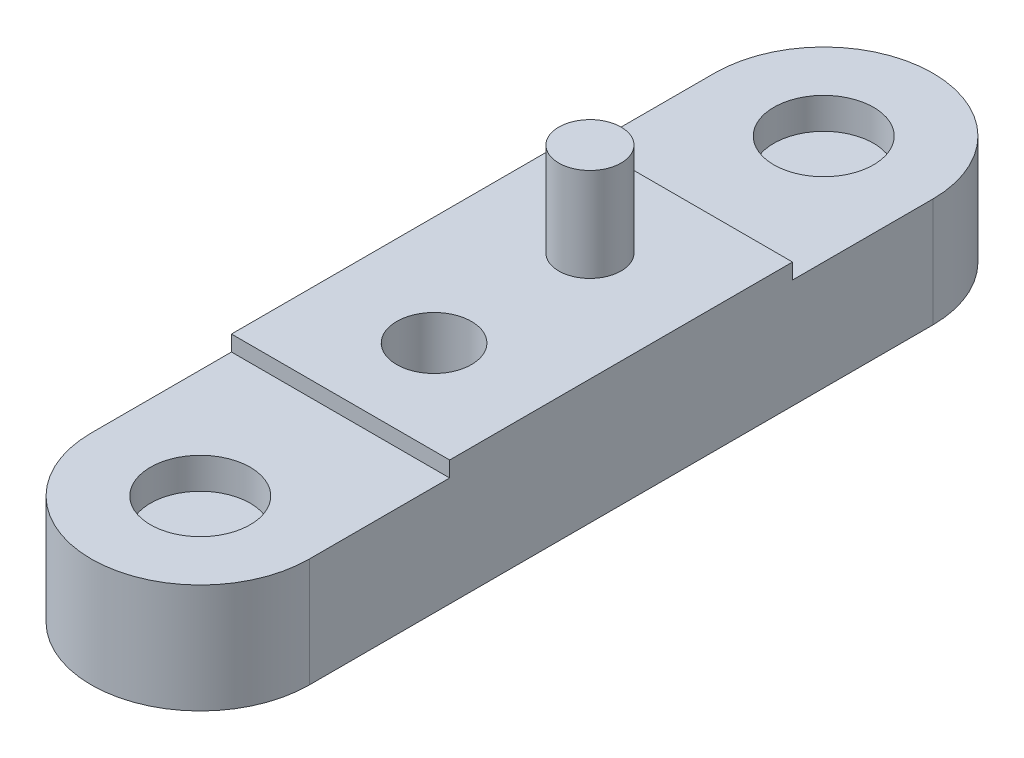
ISO-10303-21;
HEADER;
FILE_DESCRIPTION(('STEP AP214'),'2;1');
FILE_NAME('part.step','',(''),(''),'','','');
FILE_SCHEMA(('AUTOMOTIVE_DESIGN { 1 0 10303 214 1 1 1 1 }'));
ENDSEC;
DATA;
#1=APPLICATION_CONTEXT('core data for automotive mechanical design processes');
#2=APPLICATION_PROTOCOL_DEFINITION('international standard','automotive_design',2000,#1);
#3=PRODUCT_CONTEXT('',#1,'mechanical');
#4=PRODUCT('Part','Part','',(#3));
#5=PRODUCT_RELATED_PRODUCT_CATEGORY('part','',(#4));
#6=PRODUCT_DEFINITION_FORMATION('','',#4);
#7=PRODUCT_DEFINITION_CONTEXT('part definition',#1,'design');
#8=PRODUCT_DEFINITION('design','',#6,#7);
#9=PRODUCT_DEFINITION_SHAPE('','',#8);
#10=(LENGTH_UNIT() NAMED_UNIT(*) SI_UNIT(.MILLI.,.METRE.));
#11=(NAMED_UNIT(*) PLANE_ANGLE_UNIT() SI_UNIT($,.RADIAN.));
#12=(NAMED_UNIT(*) SI_UNIT($,.STERADIAN.) SOLID_ANGLE_UNIT());
#13=UNCERTAINTY_MEASURE_WITH_UNIT(LENGTH_MEASURE(1.E-05),#10,'distance_accuracy_value','');
#14=(GEOMETRIC_REPRESENTATION_CONTEXT(3) GLOBAL_UNCERTAINTY_ASSIGNED_CONTEXT((#13)) GLOBAL_UNIT_ASSIGNED_CONTEXT((#10,
#11,#12)) REPRESENTATION_CONTEXT('',''));
#15=CARTESIAN_POINT('',(0.,0.,0.));
#16=DIRECTION('',(0.,0.,1.));
#17=DIRECTION('',(1.,0.,0.));
#18=AXIS2_PLACEMENT_3D('',#15,#16,#17);
#19=CARTESIAN_POINT('',(0.,4.,0.));
#20=DIRECTION('',(0.,-1.,0.));
#21=DIRECTION('',(0.,0.,-1.));
#22=AXIS2_PLACEMENT_3D('',#19,#20,#21);
#23=CYLINDRICAL_SURFACE('',#22,3.5);
#24=CARTESIAN_POINT('',(0.,3.5,0.));
#25=DIRECTION('',(0.,1.,0.));
#26=DIRECTION('',(0.,0.,1.));
#27=AXIS2_PLACEMENT_3D('',#24,#25,#26);
#28=CIRCLE('',#27,3.5);
#29=CARTESIAN_POINT('',(3.5,3.5,0.));
#30=VERTEX_POINT('',#29);
#31=CARTESIAN_POINT('',(-3.5,3.5,0.));
#32=VERTEX_POINT('',#31);
#33=EDGE_CURVE('E157',#30,#32,#28,.T.);
#34=ORIENTED_EDGE('',*,*,#33,.F.);
#35=DIRECTION('',(0.,-1.,0.));
#36=VECTOR('',#35,1.);
#37=CARTESIAN_POINT('',(3.5,4.,0.));
#38=LINE('',#37,#36);
#39=CARTESIAN_POINT('',(3.5,0.,0.));
#40=VERTEX_POINT('',#39);
#41=EDGE_CURVE('E42',#30,#40,#38,.T.);
#42=ORIENTED_EDGE('',*,*,#41,.T.);
#43=CARTESIAN_POINT('',(0.,0.,0.));
#44=DIRECTION('',(0.,1.,0.));
#45=DIRECTION('',(0.,0.,1.));
#46=AXIS2_PLACEMENT_3D('',#43,#44,#45);
#47=CIRCLE('',#46,3.5);
#48=CARTESIAN_POINT('',(-3.5,0.,0.));
#49=VERTEX_POINT('',#48);
#50=EDGE_CURVE('E163',#40,#49,#47,.T.);
#51=ORIENTED_EDGE('',*,*,#50,.T.);
#52=DIRECTION('',(0.,-1.,0.));
#53=VECTOR('',#52,1.);
#54=CARTESIAN_POINT('',(-3.5,4.,0.));
#55=LINE('',#54,#53);
#56=EDGE_CURVE('E11',#32,#49,#55,.T.);
#57=ORIENTED_EDGE('',*,*,#56,.F.);
#58=EDGE_LOOP('',(#34,#42,#51,#57));
#59=FACE_BOUND('',#58,.T.);
#60=ADVANCED_FACE('F35',(#59),#23,.T.);
#61=CARTESIAN_POINT('',(-3.5,4.,0.));
#62=DIRECTION('',(1.,0.,0.));
#63=DIRECTION('',(0.,0.,-1.));
#64=AXIS2_PLACEMENT_3D('',#61,#62,#63);
#65=PLANE('',#64);
#66=DIRECTION('',(0.,0.,1.));
#67=VECTOR('',#66,1.);
#68=CARTESIAN_POINT('',(-3.5,4.,0.));
#69=LINE('',#68,#67);
#70=CARTESIAN_POINT('',(-3.5,4.,4.5));
#71=VERTEX_POINT('',#70);
#72=CARTESIAN_POINT('',(-3.5,4.,15.5));
#73=VERTEX_POINT('',#72);
#74=EDGE_CURVE('E165',#71,#73,#69,.T.);
#75=ORIENTED_EDGE('',*,*,#74,.F.);
#76=DIRECTION('',(0.,1.,0.));
#77=VECTOR('',#76,1.);
#78=CARTESIAN_POINT('',(-3.5,3.5,4.5));
#79=LINE('',#78,#77);
#80=CARTESIAN_POINT('',(-3.5,3.5,4.5));
#81=VERTEX_POINT('',#80);
#82=EDGE_CURVE('E49',#81,#71,#79,.T.);
#83=ORIENTED_EDGE('',*,*,#82,.F.);
#84=DIRECTION('',(0.,0.,1.));
#85=VECTOR('',#84,1.);
#86=CARTESIAN_POINT('',(-3.5,3.5,0.));
#87=LINE('',#86,#85);
#88=EDGE_CURVE('E149',#32,#81,#87,.T.);
#89=ORIENTED_EDGE('',*,*,#88,.F.);
#90=ORIENTED_EDGE('',*,*,#56,.T.);
#91=DIRECTION('',(0.,0.,1.));
#92=VECTOR('',#91,1.);
#93=CARTESIAN_POINT('',(-3.5,0.,0.));
#94=LINE('',#93,#92);
#95=CARTESIAN_POINT('',(-3.5,0.,20.));
#96=VERTEX_POINT('',#95);
#97=EDGE_CURVE('E172',#49,#96,#94,.T.);
#98=ORIENTED_EDGE('',*,*,#97,.T.);
#99=DIRECTION('',(0.,-1.,0.));
#100=VECTOR('',#99,1.);
#101=CARTESIAN_POINT('',(-3.5,4.,20.));
#102=LINE('',#101,#100);
#103=CARTESIAN_POINT('',(-3.5,3.5,20.));
#104=VERTEX_POINT('',#103);
#105=EDGE_CURVE('E123',#104,#96,#102,.T.);
#106=ORIENTED_EDGE('',*,*,#105,.F.);
#107=DIRECTION('',(0.,0.,-1.));
#108=VECTOR('',#107,1.);
#109=CARTESIAN_POINT('',(-3.5,3.5,20.));
#110=LINE('',#109,#108);
#111=CARTESIAN_POINT('',(-3.5,3.5,15.5));
#112=VERTEX_POINT('',#111);
#113=EDGE_CURVE('E103',#104,#112,#110,.T.);
#114=ORIENTED_EDGE('',*,*,#113,.T.);
#115=DIRECTION('',(0.,1.,0.));
#116=VECTOR('',#115,1.);
#117=CARTESIAN_POINT('',(-3.5,3.5,15.5));
#118=LINE('',#117,#116);
#119=EDGE_CURVE('E112',#112,#73,#118,.T.);
#120=ORIENTED_EDGE('',*,*,#119,.T.);
#121=EDGE_LOOP('',(#75,#83,#89,#90,#98,#106,#114,#120));
#122=FACE_BOUND('',#121,.T.);
#123=ADVANCED_FACE('F121',(#122),#65,.F.);
#124=CARTESIAN_POINT('',(3.5,4.,0.));
#125=DIRECTION('',(-1.,0.,0.));
#126=DIRECTION('',(0.,0.,1.));
#127=AXIS2_PLACEMENT_3D('',#124,#125,#126);
#128=PLANE('',#127);
#129=DIRECTION('',(0.,0.,-1.));
#130=VECTOR('',#129,1.);
#131=CARTESIAN_POINT('',(3.5,3.5,0.));
#132=LINE('',#131,#130);
#133=CARTESIAN_POINT('',(3.5,3.5,4.5));
#134=VERTEX_POINT('',#133);
#135=EDGE_CURVE('E155',#134,#30,#132,.T.);
#136=ORIENTED_EDGE('',*,*,#135,.F.);
#137=DIRECTION('',(0.,1.,0.));
#138=VECTOR('',#137,1.);
#139=CARTESIAN_POINT('',(3.5,3.5,4.5));
#140=LINE('',#139,#138);
#141=CARTESIAN_POINT('',(3.5,4.,4.5));
#142=VERTEX_POINT('',#141);
#143=EDGE_CURVE('E160',#134,#142,#140,.T.);
#144=ORIENTED_EDGE('',*,*,#143,.T.);
#145=DIRECTION('',(0.,0.,-1.));
#146=VECTOR('',#145,1.);
#147=CARTESIAN_POINT('',(3.5,4.,0.));
#148=LINE('',#147,#146);
#149=CARTESIAN_POINT('',(3.5,4.,15.5));
#150=VERTEX_POINT('',#149);
#151=EDGE_CURVE('E167',#150,#142,#148,.T.);
#152=ORIENTED_EDGE('',*,*,#151,.F.);
#153=DIRECTION('',(0.,1.,0.));
#154=VECTOR('',#153,1.);
#155=CARTESIAN_POINT('',(3.5,3.5,15.5));
#156=LINE('',#155,#154);
#157=CARTESIAN_POINT('',(3.5,3.5,15.5));
#158=VERTEX_POINT('',#157);
#159=EDGE_CURVE('E118',#158,#150,#156,.T.);
#160=ORIENTED_EDGE('',*,*,#159,.F.);
#161=DIRECTION('',(0.,0.,1.));
#162=VECTOR('',#161,1.);
#163=CARTESIAN_POINT('',(3.5,3.5,20.));
#164=LINE('',#163,#162);
#165=CARTESIAN_POINT('',(3.5,3.5,20.));
#166=VERTEX_POINT('',#165);
#167=EDGE_CURVE('E105',#158,#166,#164,.T.);
#168=ORIENTED_EDGE('',*,*,#167,.T.);
#169=DIRECTION('',(0.,-1.,0.));
#170=VECTOR('',#169,1.);
#171=CARTESIAN_POINT('',(3.5,4.,20.));
#172=LINE('',#171,#170);
#173=CARTESIAN_POINT('',(3.5,0.,20.));
#174=VERTEX_POINT('',#173);
#175=EDGE_CURVE('E138',#166,#174,#172,.T.);
#176=ORIENTED_EDGE('',*,*,#175,.T.);
#177=DIRECTION('',(0.,0.,-1.));
#178=VECTOR('',#177,1.);
#179=CARTESIAN_POINT('',(3.5,0.,0.));
#180=LINE('',#179,#178);
#181=EDGE_CURVE('E168',#174,#40,#180,.T.);
#182=ORIENTED_EDGE('',*,*,#181,.T.);
#183=ORIENTED_EDGE('',*,*,#41,.F.);
#184=EDGE_LOOP('',(#136,#144,#152,#160,#168,#176,#182,#183));
#185=FACE_BOUND('',#184,.T.);
#186=ADVANCED_FACE('F177',(#185),#128,.F.);
#187=CARTESIAN_POINT('',(0.,4.,0.));
#188=DIRECTION('',(0.,1.,0.));
#189=DIRECTION('',(0.,0.,1.));
#190=AXIS2_PLACEMENT_3D('',#187,#188,#189);
#191=PLANE('',#190);
#192=CARTESIAN_POINT('',(0.,4.,12.5));
#193=DIRECTION('',(0.,1.,0.));
#194=DIRECTION('',(0.,0.,1.));
#195=AXIS2_PLACEMENT_3D('',#192,#193,#194);
#196=CIRCLE('',#195,1.2);
#197=CARTESIAN_POINT('',(0.,4.,13.7));
#198=VERTEX_POINT('',#197);
#199=EDGE_CURVE('E348',#198,#198,#196,.T.);
#200=ORIENTED_EDGE('',*,*,#199,.F.);
#201=EDGE_LOOP('',(#200));
#202=FACE_BOUND('',#201,.T.);
#203=CARTESIAN_POINT('',(0.,4.,7.5));
#204=DIRECTION('',(0.,1.,0.));
#205=DIRECTION('',(0.,0.,1.));
#206=AXIS2_PLACEMENT_3D('',#203,#204,#205);
#207=CIRCLE('',#206,1.);
#208=CARTESIAN_POINT('',(0.,4.,8.5));
#209=VERTEX_POINT('',#208);
#210=EDGE_CURVE('E350',#209,#209,#207,.T.);
#211=ORIENTED_EDGE('',*,*,#210,.F.);
#212=EDGE_LOOP('',(#211));
#213=FACE_BOUND('',#212,.T.);
#214=DIRECTION('',(1.,0.,0.));
#215=VECTOR('',#214,1.);
#216=CARTESIAN_POINT('',(-3.5,4.,4.5));
#217=LINE('',#216,#215);
#218=EDGE_CURVE('E146',#71,#142,#217,.T.);
#219=ORIENTED_EDGE('',*,*,#218,.F.);
#220=ORIENTED_EDGE('',*,*,#74,.T.);
#221=DIRECTION('',(1.,0.,0.));
#222=VECTOR('',#221,1.);
#223=CARTESIAN_POINT('',(-3.5,4.,15.5));
#224=LINE('',#223,#222);
#225=EDGE_CURVE('E115',#73,#150,#224,.T.);
#226=ORIENTED_EDGE('',*,*,#225,.T.);
#227=ORIENTED_EDGE('',*,*,#151,.T.);
#228=EDGE_LOOP('',(#219,#220,#226,#227));
#229=FACE_BOUND('',#228,.T.);
#230=ADVANCED_FACE('F188',(#202,#213,#229),#191,.T.);
#231=CARTESIAN_POINT('',(0.,0.,0.));
#232=DIRECTION('',(0.,1.,0.));
#233=DIRECTION('',(0.,0.,1.));
#234=AXIS2_PLACEMENT_3D('',#231,#232,#233);
#235=PLANE('',#234);
#236=CARTESIAN_POINT('',(0.,0.,12.5));
#237=DIRECTION('',(0.,1.,0.));
#238=DIRECTION('',(0.,0.,1.));
#239=AXIS2_PLACEMENT_3D('',#236,#237,#238);
#240=CIRCLE('',#239,1.2);
#241=CARTESIAN_POINT('',(0.,0.,13.7));
#242=VERTEX_POINT('',#241);
#243=EDGE_CURVE('E345',#242,#242,#240,.T.);
#244=ORIENTED_EDGE('',*,*,#243,.T.);
#245=EDGE_LOOP('',(#244));
#246=FACE_BOUND('',#245,.T.);
#247=ORIENTED_EDGE('',*,*,#50,.F.);
#248=ORIENTED_EDGE('',*,*,#181,.F.);
#249=CARTESIAN_POINT('',(0.,0.,20.));
#250=DIRECTION('',(0.,-1.,0.));
#251=DIRECTION('',(0.,0.,-1.));
#252=AXIS2_PLACEMENT_3D('',#249,#250,#251);
#253=CIRCLE('',#252,3.5);
#254=EDGE_CURVE('E134',#174,#96,#253,.T.);
#255=ORIENTED_EDGE('',*,*,#254,.T.);
#256=ORIENTED_EDGE('',*,*,#97,.F.);
#257=EDGE_LOOP('',(#247,#248,#255,#256));
#258=FACE_BOUND('',#257,.T.);
#259=ADVANCED_FACE('F182',(#246,#258),#235,.F.);
#260=CARTESIAN_POINT('',(-3.5,3.5,4.5));
#261=DIRECTION('',(0.,0.,1.));
#262=DIRECTION('',(1.,0.,0.));
#263=AXIS2_PLACEMENT_3D('',#260,#261,#262);
#264=PLANE('',#263);
#265=ORIENTED_EDGE('',*,*,#218,.T.);
#266=ORIENTED_EDGE('',*,*,#143,.F.);
#267=DIRECTION('',(1.,0.,0.));
#268=VECTOR('',#267,1.);
#269=CARTESIAN_POINT('',(-3.5,3.5,4.5));
#270=LINE('',#269,#268);
#271=EDGE_CURVE('E152',#81,#134,#270,.T.);
#272=ORIENTED_EDGE('',*,*,#271,.F.);
#273=ORIENTED_EDGE('',*,*,#82,.T.);
#274=EDGE_LOOP('',(#265,#266,#272,#273));
#275=FACE_BOUND('',#274,.T.);
#276=ADVANCED_FACE('F213',(#275),#264,.F.);
#277=CARTESIAN_POINT('',(0.,3.5,0.));
#278=DIRECTION('',(0.,1.,0.));
#279=DIRECTION('',(0.,0.,1.));
#280=AXIS2_PLACEMENT_3D('',#277,#278,#279);
#281=PLANE('',#280);
#282=CARTESIAN_POINT('',(0.,3.5,0.));
#283=DIRECTION('',(0.,1.,0.));
#284=DIRECTION('',(0.,0.,1.));
#285=AXIS2_PLACEMENT_3D('',#282,#283,#284);
#286=CIRCLE('',#285,1.6);
#287=CARTESIAN_POINT('',(0.,3.5,1.6));
#288=VERTEX_POINT('',#287);
#289=EDGE_CURVE('E142',#288,#288,#286,.T.);
#290=ORIENTED_EDGE('',*,*,#289,.F.);
#291=EDGE_LOOP('',(#290));
#292=FACE_BOUND('',#291,.T.);
#293=ORIENTED_EDGE('',*,*,#88,.T.);
#294=ORIENTED_EDGE('',*,*,#271,.T.);
#295=ORIENTED_EDGE('',*,*,#135,.T.);
#296=ORIENTED_EDGE('',*,*,#33,.T.);
#297=EDGE_LOOP('',(#293,#294,#295,#296));
#298=FACE_BOUND('',#297,.T.);
#299=ADVANCED_FACE('F186',(#292,#298),#281,.T.);
#300=CARTESIAN_POINT('',(0.,2.5,0.));
#301=DIRECTION('',(0.,1.,0.));
#302=DIRECTION('',(0.,0.,1.));
#303=AXIS2_PLACEMENT_3D('',#300,#301,#302);
#304=CYLINDRICAL_SURFACE('',#303,1.6);
#305=CARTESIAN_POINT('',(0.,2.5,0.));
#306=DIRECTION('',(0.,1.,0.));
#307=DIRECTION('',(0.,0.,1.));
#308=AXIS2_PLACEMENT_3D('',#305,#306,#307);
#309=CIRCLE('',#308,1.6);
#310=CARTESIAN_POINT('',(0.,2.5,1.6));
#311=VERTEX_POINT('',#310);
#312=EDGE_CURVE('E143',#311,#311,#309,.T.);
#313=ORIENTED_EDGE('',*,*,#312,.F.);
#314=EDGE_LOOP('',(#313));
#315=FACE_BOUND('',#314,.T.);
#316=ORIENTED_EDGE('',*,*,#289,.T.);
#317=EDGE_LOOP('',(#316));
#318=FACE_BOUND('',#317,.T.);
#319=ADVANCED_FACE('F199',(#315,#318),#304,.F.);
#320=CARTESIAN_POINT('',(0.,2.5,0.));
#321=DIRECTION('',(0.,1.,0.));
#322=DIRECTION('',(0.,0.,1.));
#323=AXIS2_PLACEMENT_3D('',#320,#321,#322);
#324=PLANE('',#323);
#325=ORIENTED_EDGE('',*,*,#312,.T.);
#326=EDGE_LOOP('',(#325));
#327=FACE_BOUND('',#326,.T.);
#328=ADVANCED_FACE('F192',(#327),#324,.T.);
#329=CARTESIAN_POINT('',(0.,4.,20.));
#330=DIRECTION('',(0.,-1.,0.));
#331=DIRECTION('',(0.,0.,1.));
#332=AXIS2_PLACEMENT_3D('',#329,#330,#331);
#333=CYLINDRICAL_SURFACE('',#332,3.5);
#334=CARTESIAN_POINT('',(0.,3.5,20.));
#335=DIRECTION('',(0.,-1.,0.));
#336=DIRECTION('',(0.,0.,-1.));
#337=AXIS2_PLACEMENT_3D('',#334,#335,#336);
#338=CIRCLE('',#337,3.5);
#339=EDGE_CURVE('E119',#166,#104,#338,.T.);
#340=ORIENTED_EDGE('',*,*,#339,.T.);
#341=ORIENTED_EDGE('',*,*,#105,.T.);
#342=ORIENTED_EDGE('',*,*,#254,.F.);
#343=ORIENTED_EDGE('',*,*,#175,.F.);
#344=EDGE_LOOP('',(#340,#341,#342,#343));
#345=FACE_BOUND('',#344,.T.);
#346=ADVANCED_FACE('F190',(#345),#333,.T.);
#347=CARTESIAN_POINT('',(-3.5,3.5,15.5));
#348=DIRECTION('',(0.,0.,-1.));
#349=DIRECTION('',(1.,0.,0.));
#350=AXIS2_PLACEMENT_3D('',#347,#348,#349);
#351=PLANE('',#350);
#352=ORIENTED_EDGE('',*,*,#225,.F.);
#353=ORIENTED_EDGE('',*,*,#119,.F.);
#354=DIRECTION('',(1.,0.,0.));
#355=VECTOR('',#354,1.);
#356=CARTESIAN_POINT('',(-3.5,3.5,15.5));
#357=LINE('',#356,#355);
#358=EDGE_CURVE('E98',#112,#158,#357,.T.);
#359=ORIENTED_EDGE('',*,*,#358,.T.);
#360=ORIENTED_EDGE('',*,*,#159,.T.);
#361=EDGE_LOOP('',(#352,#353,#359,#360));
#362=FACE_BOUND('',#361,.T.);
#363=ADVANCED_FACE('F113',(#362),#351,.F.);
#364=CARTESIAN_POINT('',(0.,3.5,20.));
#365=DIRECTION('',(0.,1.,0.));
#366=DIRECTION('',(0.,0.,-1.));
#367=AXIS2_PLACEMENT_3D('',#364,#365,#366);
#368=PLANE('',#367);
#369=CARTESIAN_POINT('',(0.,3.5,20.));
#370=DIRECTION('',(0.,-1.,0.));
#371=DIRECTION('',(0.,0.,-1.));
#372=AXIS2_PLACEMENT_3D('',#369,#370,#371);
#373=CIRCLE('',#372,1.6);
#374=CARTESIAN_POINT('',(0.,3.5,18.4));
#375=VERTEX_POINT('',#374);
#376=EDGE_CURVE('E129',#375,#375,#373,.T.);
#377=ORIENTED_EDGE('',*,*,#376,.T.);
#378=EDGE_LOOP('',(#377));
#379=FACE_BOUND('',#378,.T.);
#380=ORIENTED_EDGE('',*,*,#113,.F.);
#381=ORIENTED_EDGE('',*,*,#339,.F.);
#382=ORIENTED_EDGE('',*,*,#167,.F.);
#383=ORIENTED_EDGE('',*,*,#358,.F.);
#384=EDGE_LOOP('',(#380,#381,#382,#383));
#385=FACE_BOUND('',#384,.T.);
#386=ADVANCED_FACE('F100',(#379,#385),#368,.T.);
#387=CARTESIAN_POINT('',(0.,2.5,20.));
#388=DIRECTION('',(0.,1.,0.));
#389=DIRECTION('',(0.,0.,-1.));
#390=AXIS2_PLACEMENT_3D('',#387,#388,#389);
#391=CYLINDRICAL_SURFACE('',#390,1.6);
#392=CARTESIAN_POINT('',(0.,2.5,20.));
#393=DIRECTION('',(0.,-1.,0.));
#394=DIRECTION('',(0.,0.,-1.));
#395=AXIS2_PLACEMENT_3D('',#392,#393,#394);
#396=CIRCLE('',#395,1.6);
#397=CARTESIAN_POINT('',(0.,2.5,18.4));
#398=VERTEX_POINT('',#397);
#399=EDGE_CURVE('E126',#398,#398,#396,.T.);
#400=ORIENTED_EDGE('',*,*,#399,.T.);
#401=EDGE_LOOP('',(#400));
#402=FACE_BOUND('',#401,.T.);
#403=ORIENTED_EDGE('',*,*,#376,.F.);
#404=EDGE_LOOP('',(#403));
#405=FACE_BOUND('',#404,.T.);
#406=ADVANCED_FACE('F290',(#402,#405),#391,.F.);
#407=CARTESIAN_POINT('',(0.,2.5,20.));
#408=DIRECTION('',(0.,1.,0.));
#409=DIRECTION('',(0.,0.,-1.));
#410=AXIS2_PLACEMENT_3D('',#407,#408,#409);
#411=PLANE('',#410);
#412=ORIENTED_EDGE('',*,*,#399,.F.);
#413=EDGE_LOOP('',(#412));
#414=FACE_BOUND('',#413,.T.);
#415=ADVANCED_FACE('F299',(#414),#411,.T.);
#416=CARTESIAN_POINT('',(0.,7.,7.5));
#417=DIRECTION('',(0.,-1.,0.));
#418=DIRECTION('',(0.,0.,-1.));
#419=AXIS2_PLACEMENT_3D('',#416,#417,#418);
#420=CYLINDRICAL_SURFACE('',#419,1.);
#421=CARTESIAN_POINT('',(0.,7.,7.5));
#422=DIRECTION('',(0.,1.,0.));
#423=DIRECTION('',(0.,0.,1.));
#424=AXIS2_PLACEMENT_3D('',#421,#422,#423);
#425=CIRCLE('',#424,1.);
#426=CARTESIAN_POINT('',(0.,7.,8.5));
#427=VERTEX_POINT('',#426);
#428=EDGE_CURVE('E353',#427,#427,#425,.T.);
#429=ORIENTED_EDGE('',*,*,#428,.F.);
#430=EDGE_LOOP('',(#429));
#431=FACE_BOUND('',#430,.T.);
#432=ORIENTED_EDGE('',*,*,#210,.T.);
#433=EDGE_LOOP('',(#432));
#434=FACE_BOUND('',#433,.T.);
#435=ADVANCED_FACE('F308',(#431,#434),#420,.T.);
#436=CARTESIAN_POINT('',(0.,7.,7.5));
#437=DIRECTION('',(0.,1.,0.));
#438=DIRECTION('',(0.,0.,1.));
#439=AXIS2_PLACEMENT_3D('',#436,#437,#438);
#440=PLANE('',#439);
#441=ORIENTED_EDGE('',*,*,#428,.T.);
#442=EDGE_LOOP('',(#441));
#443=FACE_BOUND('',#442,.T.);
#444=ADVANCED_FACE('F317',(#443),#440,.T.);
#445=CARTESIAN_POINT('',(0.,0.,12.5));
#446=DIRECTION('',(0.,1.,0.));
#447=DIRECTION('',(0.,0.,1.));
#448=AXIS2_PLACEMENT_3D('',#445,#446,#447);
#449=CYLINDRICAL_SURFACE('',#448,1.2);
#450=ORIENTED_EDGE('',*,*,#243,.F.);
#451=EDGE_LOOP('',(#450));
#452=FACE_BOUND('',#451,.T.);
#453=ORIENTED_EDGE('',*,*,#199,.T.);
#454=EDGE_LOOP('',(#453));
#455=FACE_BOUND('',#454,.T.);
#456=ADVANCED_FACE('F325',(#452,#455),#449,.F.);
#457=CLOSED_SHELL('',(#60,#123,#186,#230,#259,#276,#299,#319,#328,#346,#363,#386,#406,#415,#435,
#444,#456));
#458=MANIFOLD_SOLID_BREP('B2',#457);
#459=ADVANCED_BREP_SHAPE_REPRESENTATION('',(#18,#458),#14);
#460=SHAPE_DEFINITION_REPRESENTATION(#9,#459);
ENDSEC;
END-ISO-10303-21;
